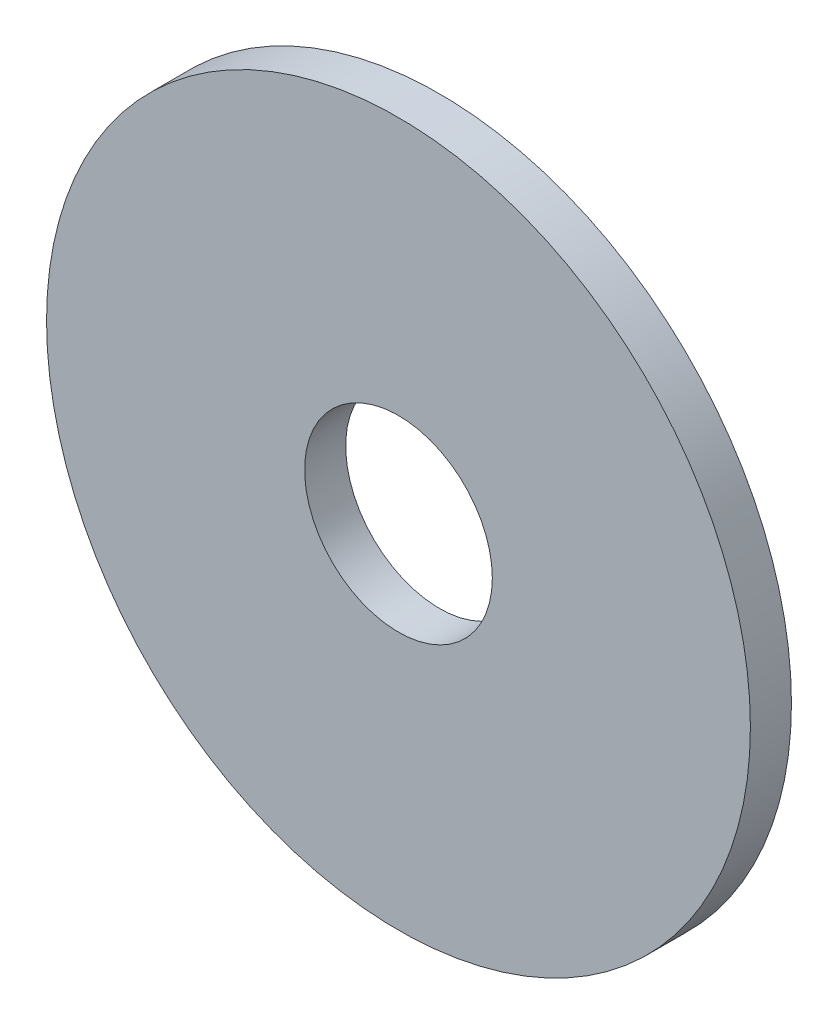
from build123d import *

# Parameters (mm, degrees)
ESQUISSE1_R      = 6
ESQUISSE1_R_2    = 1.6
EXTRUSION1_DEPTH = 0.7


with BuildPart() as part:
    # Esquisse1 → Extrusion1 (new body)
    with BuildSketch(Plane.XY):
        Circle(ESQUISSE1_R)
        Circle(ESQUISSE1_R_2, mode=Mode.SUBTRACT)
    extrude(amount=EXTRUSION1_DEPTH)


solid = part.part
